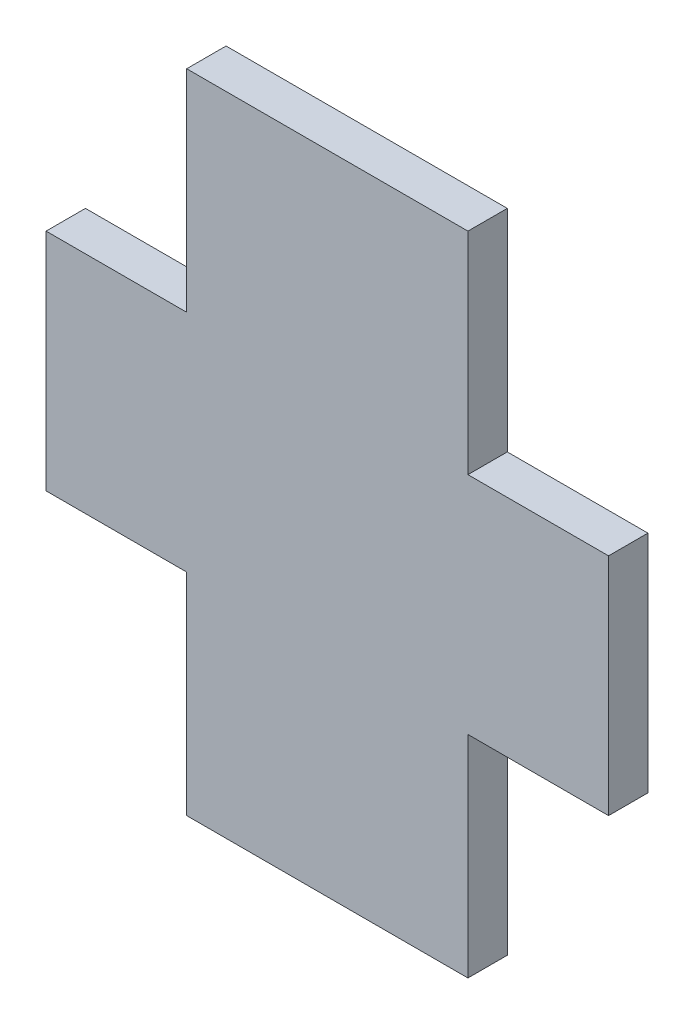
from build123d import *

# Parameters (mm, degrees)
SALIENTE_EXTRUIR1_DEPTH = 2.8


with BuildPart() as part:
    # Croquis1 → Saliente-Extruir1 (new body)
    with BuildSketch(Plane.XY):
        Polygon((-10, 8), (-10, 23), (10, 23), (10, 8), (20, 8), (20, -8), (10, -8), (10, -23), (-10, -23), (-10, -8), (-20, -8), (-20, 8), align=None)
    extrude(amount=SALIENTE_EXTRUIR1_DEPTH)


solid = part.part
